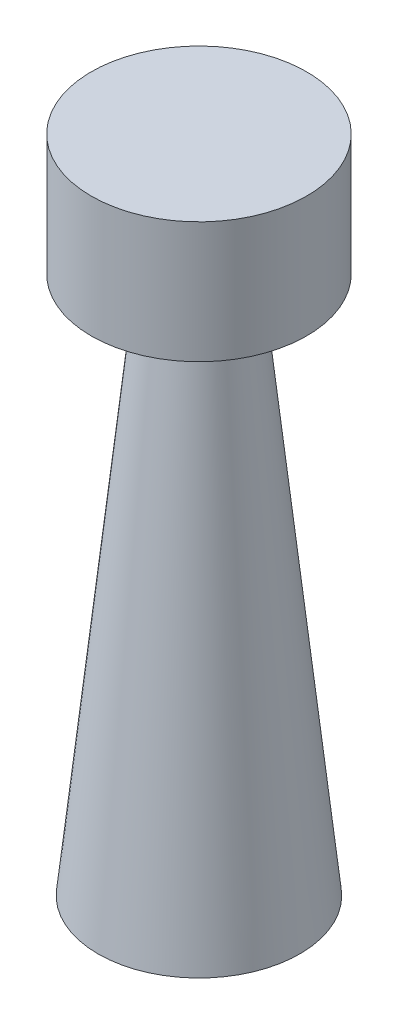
from build123d import *

# Parameters (mm, degrees)
ESQUISSE1_R        = 375
BOSS_EXTRU_1_DEPTH = 2000
BOSS_EXTRU_1_TAPER = 6
ESQUISSE2_R        = 400
BOSS_EXTRU_2_DEPTH = 450


with BuildPart() as part:
    # Esquisse1 → Boss.-Extru.1 (new body)
    with BuildSketch(Plane(origin=(0, 0, 0), x_dir=(1, 0, 0), z_dir=(0, 1, 0))):
        Circle(ESQUISSE1_R)
    extrude(amount=BOSS_EXTRU_1_DEPTH, taper=BOSS_EXTRU_1_TAPER)

    # Esquisse2 → Boss.-Extru.2 (add)
    with BuildSketch(Plane(origin=(0, 2000, 0), x_dir=(1, 0, 0), z_dir=(0, 1, 0))):
        with Locations(Location((0, 0, 0), (0, 0, 270))):
            Circle(ESQUISSE2_R)
    extrude(amount=BOSS_EXTRU_2_DEPTH)


solid = part.part
